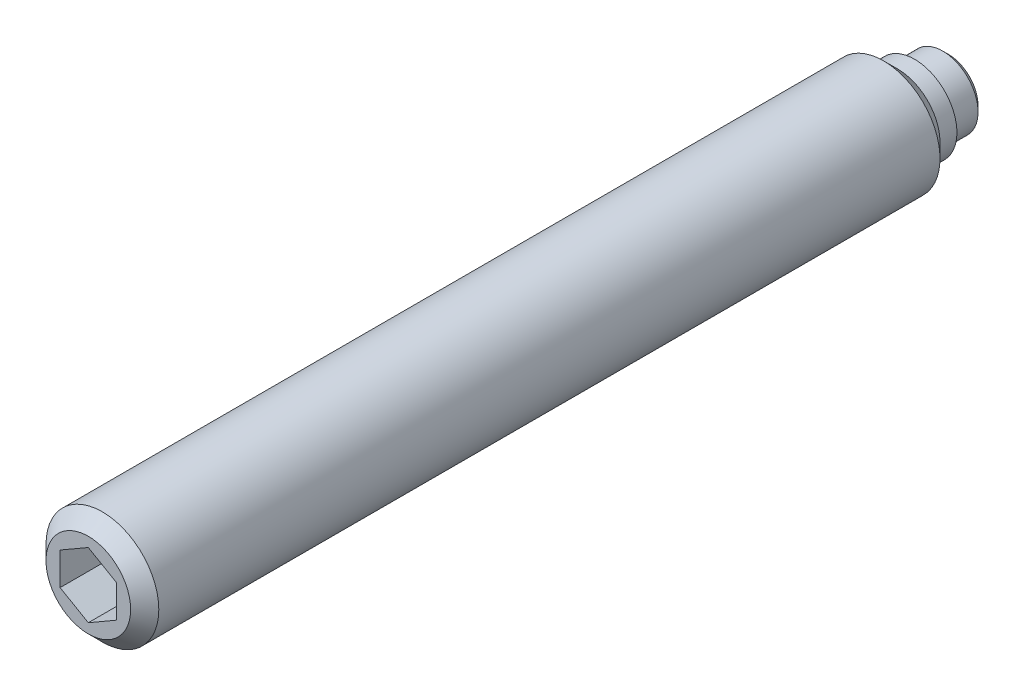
ISO-10303-21;
HEADER;
FILE_DESCRIPTION(('STEP AP214'),'2;1');
FILE_NAME('part.step','',(''),(''),'','','');
FILE_SCHEMA(('AUTOMOTIVE_DESIGN { 1 0 10303 214 1 1 1 1 }'));
ENDSEC;
DATA;
#1=APPLICATION_CONTEXT('core data for automotive mechanical design processes');
#2=APPLICATION_PROTOCOL_DEFINITION('international standard','automotive_design',2000,#1);
#3=PRODUCT_CONTEXT('',#1,'mechanical');
#4=PRODUCT('Part','Part','',(#3));
#5=PRODUCT_RELATED_PRODUCT_CATEGORY('part','',(#4));
#6=PRODUCT_DEFINITION_FORMATION('','',#4);
#7=PRODUCT_DEFINITION_CONTEXT('part definition',#1,'design');
#8=PRODUCT_DEFINITION('design','',#6,#7);
#9=PRODUCT_DEFINITION_SHAPE('','',#8);
#10=(LENGTH_UNIT() NAMED_UNIT(*) SI_UNIT(.MILLI.,.METRE.));
#11=(NAMED_UNIT(*) PLANE_ANGLE_UNIT() SI_UNIT($,.RADIAN.));
#12=(NAMED_UNIT(*) SI_UNIT($,.STERADIAN.) SOLID_ANGLE_UNIT());
#13=UNCERTAINTY_MEASURE_WITH_UNIT(LENGTH_MEASURE(1.E-05),#10,'distance_accuracy_value','');
#14=(GEOMETRIC_REPRESENTATION_CONTEXT(3) GLOBAL_UNCERTAINTY_ASSIGNED_CONTEXT((#13)) GLOBAL_UNIT_ASSIGNED_CONTEXT((#10,
#11,#12)) REPRESENTATION_CONTEXT('',''));
#15=CARTESIAN_POINT('',(0.,0.,0.));
#16=DIRECTION('',(0.,0.,1.));
#17=DIRECTION('',(1.,0.,0.));
#18=AXIS2_PLACEMENT_3D('',#15,#16,#17);
#19=CARTESIAN_POINT('',(0.,0.,1.2));
#20=DIRECTION('',(0.,0.,-1.));
#21=DIRECTION('',(-1.,0.,0.));
#22=AXIS2_PLACEMENT_3D('',#19,#20,#21);
#23=CYLINDRICAL_SURFACE('',#22,2.);
#24=CARTESIAN_POINT('',(0.,0.,2.3));
#25=DIRECTION('',(0.,0.,-1.));
#26=DIRECTION('',(-1.,0.,0.));
#27=AXIS2_PLACEMENT_3D('',#24,#25,#26);
#28=CIRCLE('',#27,2.);
#29=CARTESIAN_POINT('',(-2.,0.,2.3));
#30=VERTEX_POINT('',#29);
#31=EDGE_CURVE('E9',#30,#30,#28,.T.);
#32=ORIENTED_EDGE('',*,*,#31,.F.);
#33=EDGE_LOOP('',(#32));
#34=FACE_BOUND('',#33,.T.);
#35=CARTESIAN_POINT('',(0.,0.,30.));
#36=DIRECTION('',(0.,0.,1.));
#37=DIRECTION('',(1.,0.,0.));
#38=AXIS2_PLACEMENT_3D('',#35,#36,#37);
#39=CIRCLE('',#38,2.);
#40=CARTESIAN_POINT('',(2.,0.,30.));
#41=VERTEX_POINT('',#40);
#42=EDGE_CURVE('E115',#41,#41,#39,.T.);
#43=ORIENTED_EDGE('',*,*,#42,.F.);
#44=EDGE_LOOP('',(#43));
#45=FACE_BOUND('',#44,.T.);
#46=ADVANCED_FACE('F14',(#34,#45),#23,.T.);
#47=CARTESIAN_POINT('',(0.,0.,2.3));
#48=DIRECTION('',(0.,0.,1.));
#49=DIRECTION('',(1.,0.,0.));
#50=AXIS2_PLACEMENT_3D('',#47,#48,#49);
#51=CONICAL_SURFACE('',#50,2.,0.785398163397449);
#52=ORIENTED_EDGE('',*,*,#31,.T.);
#53=EDGE_LOOP('',(#52));
#54=FACE_BOUND('',#53,.T.);
#55=CARTESIAN_POINT('',(0.,0.,1.8));
#56=DIRECTION('',(0.,0.,-1.));
#57=DIRECTION('',(-1.,0.,0.));
#58=AXIS2_PLACEMENT_3D('',#55,#56,#57);
#59=CIRCLE('',#58,1.5);
#60=CARTESIAN_POINT('',(-1.5,0.,1.8));
#61=VERTEX_POINT('',#60);
#62=EDGE_CURVE('E21',#61,#61,#59,.T.);
#63=ORIENTED_EDGE('',*,*,#62,.F.);
#64=EDGE_LOOP('',(#63));
#65=FACE_BOUND('',#64,.T.);
#66=ADVANCED_FACE('F142',(#54,#65),#51,.T.);
#67=CARTESIAN_POINT('',(0.,0.,1.2));
#68=DIRECTION('',(0.,0.,-1.));
#69=DIRECTION('',(-1.,0.,0.));
#70=AXIS2_PLACEMENT_3D('',#67,#68,#69);
#71=CYLINDRICAL_SURFACE('',#70,1.5);
#72=CARTESIAN_POINT('',(0.,0.,1.2));
#73=DIRECTION('',(0.,0.,-1.));
#74=DIRECTION('',(-1.,0.,0.));
#75=AXIS2_PLACEMENT_3D('',#72,#73,#74);
#76=CIRCLE('',#75,1.5);
#77=CARTESIAN_POINT('',(-1.5,0.,1.2));
#78=VERTEX_POINT('',#77);
#79=EDGE_CURVE('E135',#78,#78,#76,.T.);
#80=ORIENTED_EDGE('',*,*,#79,.F.);
#81=EDGE_LOOP('',(#80));
#82=FACE_BOUND('',#81,.T.);
#83=ORIENTED_EDGE('',*,*,#62,.T.);
#84=EDGE_LOOP('',(#83));
#85=FACE_BOUND('',#84,.T.);
#86=ADVANCED_FACE('F140',(#82,#85),#71,.T.);
#87=CARTESIAN_POINT('',(0.,1.5,1.2));
#88=DIRECTION('',(0.,0.,1.));
#89=DIRECTION('',(1.,0.,0.));
#90=AXIS2_PLACEMENT_3D('',#87,#88,#89);
#91=PLANE('',#90);
#92=CARTESIAN_POINT('',(0.,0.,1.2));
#93=DIRECTION('',(0.,0.,-1.));
#94=DIRECTION('',(-1.,0.,0.));
#95=AXIS2_PLACEMENT_3D('',#92,#93,#94);
#96=CIRCLE('',#95,1.25);
#97=CARTESIAN_POINT('',(-1.25,0.,1.2));
#98=VERTEX_POINT('',#97);
#99=EDGE_CURVE('E132',#98,#98,#96,.T.);
#100=ORIENTED_EDGE('',*,*,#99,.F.);
#101=EDGE_LOOP('',(#100));
#102=FACE_BOUND('',#101,.T.);
#103=ORIENTED_EDGE('',*,*,#79,.T.);
#104=EDGE_LOOP('',(#103));
#105=FACE_BOUND('',#104,.T.);
#106=ADVANCED_FACE('F150',(#102,#105),#91,.F.);
#107=CARTESIAN_POINT('',(0.,0.,0.));
#108=DIRECTION('',(0.,0.,-1.));
#109=DIRECTION('',(-1.,0.,0.));
#110=AXIS2_PLACEMENT_3D('',#107,#108,#109);
#111=CYLINDRICAL_SURFACE('',#110,1.25);
#112=CARTESIAN_POINT('',(0.,0.,0.2));
#113=DIRECTION('',(0.,0.,-1.));
#114=DIRECTION('',(-1.,0.,0.));
#115=AXIS2_PLACEMENT_3D('',#112,#113,#114);
#116=CIRCLE('',#115,1.25);
#117=CARTESIAN_POINT('',(-1.25,0.,0.2));
#118=VERTEX_POINT('',#117);
#119=EDGE_CURVE('E129',#118,#118,#116,.T.);
#120=ORIENTED_EDGE('',*,*,#119,.F.);
#121=EDGE_LOOP('',(#120));
#122=FACE_BOUND('',#121,.T.);
#123=ORIENTED_EDGE('',*,*,#99,.T.);
#124=EDGE_LOOP('',(#123));
#125=FACE_BOUND('',#124,.T.);
#126=ADVANCED_FACE('F157',(#122,#125),#111,.T.);
#127=CARTESIAN_POINT('',(0.,0.,0.2));
#128=DIRECTION('',(0.,0.,1.));
#129=DIRECTION('',(1.,0.,0.));
#130=AXIS2_PLACEMENT_3D('',#127,#128,#129);
#131=CONICAL_SURFACE('',#130,1.25,0.785398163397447);
#132=CARTESIAN_POINT('',(0.,0.,0.));
#133=DIRECTION('',(0.,0.,-1.));
#134=DIRECTION('',(-1.,0.,0.));
#135=AXIS2_PLACEMENT_3D('',#132,#133,#134);
#136=CIRCLE('',#135,1.05);
#137=CARTESIAN_POINT('',(-1.05,0.,0.));
#138=VERTEX_POINT('',#137);
#139=EDGE_CURVE('E126',#138,#138,#136,.T.);
#140=ORIENTED_EDGE('',*,*,#139,.F.);
#141=EDGE_LOOP('',(#140));
#142=FACE_BOUND('',#141,.T.);
#143=ORIENTED_EDGE('',*,*,#119,.T.);
#144=EDGE_LOOP('',(#143));
#145=FACE_BOUND('',#144,.T.);
#146=ADVANCED_FACE('F161',(#142,#145),#131,.T.);
#147=CARTESIAN_POINT('',(0.,1.05,0.));
#148=DIRECTION('',(0.,0.,1.));
#149=DIRECTION('',(1.,0.,0.));
#150=AXIS2_PLACEMENT_3D('',#147,#148,#149);
#151=PLANE('',#150);
#152=ORIENTED_EDGE('',*,*,#139,.T.);
#153=EDGE_LOOP('',(#152));
#154=FACE_BOUND('',#153,.T.);
#155=ADVANCED_FACE('F165',(#154),#151,.F.);
#156=CARTESIAN_POINT('',(0.,0.,30.5));
#157=DIRECTION('',(0.,0.,1.));
#158=DIRECTION('',(1.,0.,0.));
#159=AXIS2_PLACEMENT_3D('',#156,#157,#158);
#160=PLANE('',#159);
#161=DIRECTION('',(0.866025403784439,-0.5,0.));
#162=VECTOR('',#161,1.);
#163=CARTESIAN_POINT('',(-1.,-0.577350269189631,30.5));
#164=LINE('',#163,#162);
#165=CARTESIAN_POINT('',(-1.,-0.577350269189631,30.5));
#166=VERTEX_POINT('',#165);
#167=CARTESIAN_POINT('',(0.,-1.15470053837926,30.5));
#168=VERTEX_POINT('',#167);
#169=EDGE_CURVE('E28',#166,#168,#164,.T.);
#170=ORIENTED_EDGE('',*,*,#169,.F.);
#171=DIRECTION('',(0.,-1.,0.));
#172=VECTOR('',#171,1.);
#173=CARTESIAN_POINT('',(-1.,0.577350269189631,30.5));
#174=LINE('',#173,#172);
#175=CARTESIAN_POINT('',(-1.,0.577350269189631,30.5));
#176=VERTEX_POINT('',#175);
#177=EDGE_CURVE('E111',#176,#166,#174,.T.);
#178=ORIENTED_EDGE('',*,*,#177,.F.);
#179=DIRECTION('',(-0.866025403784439,-0.5,0.));
#180=VECTOR('',#179,1.);
#181=CARTESIAN_POINT('',(0.,1.15470053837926,30.5));
#182=LINE('',#181,#180);
#183=CARTESIAN_POINT('',(0.,1.15470053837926,30.5));
#184=VERTEX_POINT('',#183);
#185=EDGE_CURVE('E109',#184,#176,#182,.T.);
#186=ORIENTED_EDGE('',*,*,#185,.F.);
#187=DIRECTION('',(-0.866025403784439,0.5,0.));
#188=VECTOR('',#187,1.);
#189=CARTESIAN_POINT('',(1.,0.577350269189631,30.5));
#190=LINE('',#189,#188);
#191=CARTESIAN_POINT('',(1.,0.577350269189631,30.5));
#192=VERTEX_POINT('',#191);
#193=EDGE_CURVE('E76',#192,#184,#190,.T.);
#194=ORIENTED_EDGE('',*,*,#193,.F.);
#195=DIRECTION('',(0.,1.,0.));
#196=VECTOR('',#195,1.);
#197=CARTESIAN_POINT('',(1.,-0.577350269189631,30.5));
#198=LINE('',#197,#196);
#199=CARTESIAN_POINT('',(1.,-0.577350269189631,30.5));
#200=VERTEX_POINT('',#199);
#201=EDGE_CURVE('E105',#200,#192,#198,.T.);
#202=ORIENTED_EDGE('',*,*,#201,.F.);
#203=DIRECTION('',(0.866025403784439,0.5,0.));
#204=VECTOR('',#203,1.);
#205=CARTESIAN_POINT('',(0.,-1.15470053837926,30.5));
#206=LINE('',#205,#204);
#207=EDGE_CURVE('E102',#168,#200,#206,.T.);
#208=ORIENTED_EDGE('',*,*,#207,.F.);
#209=EDGE_LOOP('',(#170,#178,#186,#194,#202,#208));
#210=FACE_BOUND('',#209,.T.);
#211=CARTESIAN_POINT('',(0.,0.,30.5));
#212=DIRECTION('',(0.,0.,1.));
#213=DIRECTION('',(1.,0.,0.));
#214=AXIS2_PLACEMENT_3D('',#211,#212,#213);
#215=CIRCLE('',#214,1.5);
#216=CARTESIAN_POINT('',(1.5,0.,30.5));
#217=VERTEX_POINT('',#216);
#218=EDGE_CURVE('E123',#217,#217,#215,.T.);
#219=ORIENTED_EDGE('',*,*,#218,.T.);
#220=EDGE_LOOP('',(#219));
#221=FACE_BOUND('',#220,.T.);
#222=ADVANCED_FACE('F169',(#210,#221),#160,.T.);
#223=CARTESIAN_POINT('',(0.,0.,30.5));
#224=DIRECTION('',(0.,0.,-1.));
#225=DIRECTION('',(-1.,0.,0.));
#226=AXIS2_PLACEMENT_3D('',#223,#224,#225);
#227=CONICAL_SURFACE('',#226,1.5,0.785398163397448);
#228=ORIENTED_EDGE('',*,*,#42,.T.);
#229=EDGE_LOOP('',(#228));
#230=FACE_BOUND('',#229,.T.);
#231=ORIENTED_EDGE('',*,*,#218,.F.);
#232=EDGE_LOOP('',(#231));
#233=FACE_BOUND('',#232,.T.);
#234=ADVANCED_FACE('F173',(#230,#233),#227,.T.);
#235=CARTESIAN_POINT('',(-1.,-0.577350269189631,28.));
#236=DIRECTION('',(-0.5,-0.866025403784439,0.));
#237=DIRECTION('',(0.866025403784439,-0.5,0.));
#238=AXIS2_PLACEMENT_3D('',#235,#236,#237);
#239=PLANE('',#238);
#240=ORIENTED_EDGE('',*,*,#169,.T.);
#241=DIRECTION('',(0.,0.,1.));
#242=VECTOR('',#241,1.);
#243=CARTESIAN_POINT('',(0.,-1.15470053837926,28.));
#244=LINE('',#243,#242);
#245=CARTESIAN_POINT('',(0.,-1.15470053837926,28.));
#246=VERTEX_POINT('',#245);
#247=EDGE_CURVE('E58',#246,#168,#244,.T.);
#248=ORIENTED_EDGE('',*,*,#247,.F.);
#249=DIRECTION('',(0.866025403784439,-0.5,0.));
#250=VECTOR('',#249,1.);
#251=CARTESIAN_POINT('',(-1.,-0.577350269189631,28.));
#252=LINE('',#251,#250);
#253=CARTESIAN_POINT('',(-1.,-0.577350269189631,28.));
#254=VERTEX_POINT('',#253);
#255=EDGE_CURVE('E113',#254,#246,#252,.T.);
#256=ORIENTED_EDGE('',*,*,#255,.F.);
#257=DIRECTION('',(0.,0.,1.));
#258=VECTOR('',#257,1.);
#259=CARTESIAN_POINT('',(-1.,-0.577350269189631,28.));
#260=LINE('',#259,#258);
#261=EDGE_CURVE('E36',#254,#166,#260,.T.);
#262=ORIENTED_EDGE('',*,*,#261,.T.);
#263=EDGE_LOOP('',(#240,#248,#256,#262));
#264=FACE_BOUND('',#263,.T.);
#265=ADVANCED_FACE('F177',(#264),#239,.F.);
#266=CARTESIAN_POINT('',(-1.,0.577350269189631,28.));
#267=DIRECTION('',(-1.,0.,0.));
#268=DIRECTION('',(0.,0.,1.));
#269=AXIS2_PLACEMENT_3D('',#266,#267,#268);
#270=PLANE('',#269);
#271=ORIENTED_EDGE('',*,*,#177,.T.);
#272=ORIENTED_EDGE('',*,*,#261,.F.);
#273=DIRECTION('',(0.,-1.,0.));
#274=VECTOR('',#273,1.);
#275=CARTESIAN_POINT('',(-1.,0.577350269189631,28.));
#276=LINE('',#275,#274);
#277=CARTESIAN_POINT('',(-1.,0.577350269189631,28.));
#278=VERTEX_POINT('',#277);
#279=EDGE_CURVE('E88',#278,#254,#276,.T.);
#280=ORIENTED_EDGE('',*,*,#279,.F.);
#281=DIRECTION('',(0.,0.,1.));
#282=VECTOR('',#281,1.);
#283=CARTESIAN_POINT('',(-1.,0.577350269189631,28.));
#284=LINE('',#283,#282);
#285=EDGE_CURVE('E80',#278,#176,#284,.T.);
#286=ORIENTED_EDGE('',*,*,#285,.T.);
#287=EDGE_LOOP('',(#271,#272,#280,#286));
#288=FACE_BOUND('',#287,.T.);
#289=ADVANCED_FACE('F181',(#288),#270,.F.);
#290=CARTESIAN_POINT('',(0.,1.15470053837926,28.));
#291=DIRECTION('',(-0.5,0.866025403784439,0.));
#292=DIRECTION('',(-0.866025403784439,-0.5,0.));
#293=AXIS2_PLACEMENT_3D('',#290,#291,#292);
#294=PLANE('',#293);
#295=ORIENTED_EDGE('',*,*,#185,.T.);
#296=ORIENTED_EDGE('',*,*,#285,.F.);
#297=DIRECTION('',(-0.866025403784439,-0.5,0.));
#298=VECTOR('',#297,1.);
#299=CARTESIAN_POINT('',(0.,1.15470053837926,28.));
#300=LINE('',#299,#298);
#301=CARTESIAN_POINT('',(0.,1.15470053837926,28.));
#302=VERTEX_POINT('',#301);
#303=EDGE_CURVE('E84',#302,#278,#300,.T.);
#304=ORIENTED_EDGE('',*,*,#303,.F.);
#305=DIRECTION('',(0.,0.,1.));
#306=VECTOR('',#305,1.);
#307=CARTESIAN_POINT('',(0.,1.15470053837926,28.));
#308=LINE('',#307,#306);
#309=EDGE_CURVE('E69',#302,#184,#308,.T.);
#310=ORIENTED_EDGE('',*,*,#309,.T.);
#311=EDGE_LOOP('',(#295,#296,#304,#310));
#312=FACE_BOUND('',#311,.T.);
#313=ADVANCED_FACE('F85',(#312),#294,.F.);
#314=CARTESIAN_POINT('',(1.,0.577350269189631,28.));
#315=DIRECTION('',(0.5,0.866025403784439,0.));
#316=DIRECTION('',(-0.866025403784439,0.5,0.));
#317=AXIS2_PLACEMENT_3D('',#314,#315,#316);
#318=PLANE('',#317);
#319=ORIENTED_EDGE('',*,*,#193,.T.);
#320=ORIENTED_EDGE('',*,*,#309,.F.);
#321=DIRECTION('',(-0.866025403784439,0.5,0.));
#322=VECTOR('',#321,1.);
#323=CARTESIAN_POINT('',(1.,0.577350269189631,28.));
#324=LINE('',#323,#322);
#325=CARTESIAN_POINT('',(1.,0.577350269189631,28.));
#326=VERTEX_POINT('',#325);
#327=EDGE_CURVE('E73',#326,#302,#324,.T.);
#328=ORIENTED_EDGE('',*,*,#327,.F.);
#329=DIRECTION('',(0.,0.,1.));
#330=VECTOR('',#329,1.);
#331=CARTESIAN_POINT('',(1.,0.577350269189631,28.));
#332=LINE('',#331,#330);
#333=EDGE_CURVE('E81',#326,#192,#332,.T.);
#334=ORIENTED_EDGE('',*,*,#333,.T.);
#335=EDGE_LOOP('',(#319,#320,#328,#334));
#336=FACE_BOUND('',#335,.T.);
#337=ADVANCED_FACE('F71',(#336),#318,.F.);
#338=CARTESIAN_POINT('',(1.,-0.577350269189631,28.));
#339=DIRECTION('',(1.,0.,0.));
#340=DIRECTION('',(0.,0.,-1.));
#341=AXIS2_PLACEMENT_3D('',#338,#339,#340);
#342=PLANE('',#341);
#343=ORIENTED_EDGE('',*,*,#201,.T.);
#344=ORIENTED_EDGE('',*,*,#333,.F.);
#345=DIRECTION('',(0.,1.,0.));
#346=VECTOR('',#345,1.);
#347=CARTESIAN_POINT('',(1.,-0.577350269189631,28.));
#348=LINE('',#347,#346);
#349=CARTESIAN_POINT('',(1.,-0.577350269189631,28.));
#350=VERTEX_POINT('',#349);
#351=EDGE_CURVE('E94',#350,#326,#348,.T.);
#352=ORIENTED_EDGE('',*,*,#351,.F.);
#353=DIRECTION('',(0.,0.,1.));
#354=VECTOR('',#353,1.);
#355=CARTESIAN_POINT('',(1.,-0.577350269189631,28.));
#356=LINE('',#355,#354);
#357=EDGE_CURVE('E118',#350,#200,#356,.T.);
#358=ORIENTED_EDGE('',*,*,#357,.T.);
#359=EDGE_LOOP('',(#343,#344,#352,#358));
#360=FACE_BOUND('',#359,.T.);
#361=ADVANCED_FACE('F185',(#360),#342,.F.);
#362=CARTESIAN_POINT('',(0.,-1.15470053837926,28.));
#363=DIRECTION('',(0.5,-0.866025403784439,0.));
#364=DIRECTION('',(0.866025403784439,0.5,0.));
#365=AXIS2_PLACEMENT_3D('',#362,#363,#364);
#366=PLANE('',#365);
#367=ORIENTED_EDGE('',*,*,#207,.T.);
#368=ORIENTED_EDGE('',*,*,#357,.F.);
#369=DIRECTION('',(0.866025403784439,0.5,0.));
#370=VECTOR('',#369,1.);
#371=CARTESIAN_POINT('',(0.,-1.15470053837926,28.));
#372=LINE('',#371,#370);
#373=EDGE_CURVE('E96',#246,#350,#372,.T.);
#374=ORIENTED_EDGE('',*,*,#373,.F.);
#375=ORIENTED_EDGE('',*,*,#247,.T.);
#376=EDGE_LOOP('',(#367,#368,#374,#375));
#377=FACE_BOUND('',#376,.T.);
#378=ADVANCED_FACE('F182',(#377),#366,.F.);
#379=CARTESIAN_POINT('',(0.,0.,28.));
#380=DIRECTION('',(0.,0.,1.));
#381=DIRECTION('',(1.,0.,0.));
#382=AXIS2_PLACEMENT_3D('',#379,#380,#381);
#383=PLANE('',#382);
#384=ORIENTED_EDGE('',*,*,#255,.T.);
#385=ORIENTED_EDGE('',*,*,#373,.T.);
#386=ORIENTED_EDGE('',*,*,#351,.T.);
#387=ORIENTED_EDGE('',*,*,#327,.T.);
#388=ORIENTED_EDGE('',*,*,#303,.T.);
#389=ORIENTED_EDGE('',*,*,#279,.T.);
#390=EDGE_LOOP('',(#384,#385,#386,#387,#388,#389));
#391=FACE_BOUND('',#390,.T.);
#392=ADVANCED_FACE('F91',(#391),#383,.T.);
#393=CLOSED_SHELL('',(#46,#66,#86,#106,#126,#146,#155,#222,#234,#265,#289,#313,#337,#361,#378,#392));
#394=MANIFOLD_SOLID_BREP('B1',#393);
#395=ADVANCED_BREP_SHAPE_REPRESENTATION('',(#18,#394),#14);
#396=SHAPE_DEFINITION_REPRESENTATION(#9,#395);
ENDSEC;
END-ISO-10303-21;
